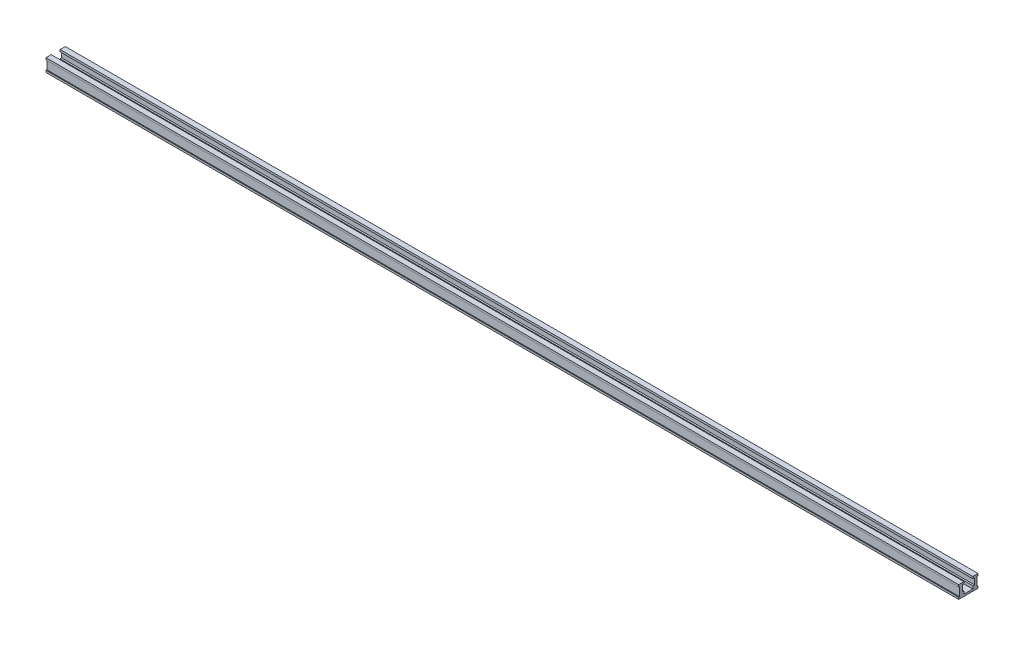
ISO-10303-21;
HEADER;
FILE_DESCRIPTION(('STEP AP214'),'2;1');
FILE_NAME('part.step','',(''),(''),'','','');
FILE_SCHEMA(('AUTOMOTIVE_DESIGN { 1 0 10303 214 1 1 1 1 }'));
ENDSEC;
DATA;
#1=APPLICATION_CONTEXT('core data for automotive mechanical design processes');
#2=APPLICATION_PROTOCOL_DEFINITION('international standard','automotive_design',2000,#1);
#3=PRODUCT_CONTEXT('',#1,'mechanical');
#4=PRODUCT('Part','Part','',(#3));
#5=PRODUCT_RELATED_PRODUCT_CATEGORY('part','',(#4));
#6=PRODUCT_DEFINITION_FORMATION('','',#4);
#7=PRODUCT_DEFINITION_CONTEXT('part definition',#1,'design');
#8=PRODUCT_DEFINITION('design','',#6,#7);
#9=PRODUCT_DEFINITION_SHAPE('','',#8);
#10=(LENGTH_UNIT() NAMED_UNIT(*) SI_UNIT(.MILLI.,.METRE.));
#11=(NAMED_UNIT(*) PLANE_ANGLE_UNIT() SI_UNIT($,.RADIAN.));
#12=(NAMED_UNIT(*) SI_UNIT($,.STERADIAN.) SOLID_ANGLE_UNIT());
#13=UNCERTAINTY_MEASURE_WITH_UNIT(LENGTH_MEASURE(1.E-05),#10,'distance_accuracy_value','');
#14=(GEOMETRIC_REPRESENTATION_CONTEXT(3) GLOBAL_UNCERTAINTY_ASSIGNED_CONTEXT((#13)) GLOBAL_UNIT_ASSIGNED_CONTEXT((#10,
#11,#12)) REPRESENTATION_CONTEXT('',''));
#15=CARTESIAN_POINT('',(0.,0.,0.));
#16=DIRECTION('',(0.,0.,1.));
#17=DIRECTION('',(1.,0.,0.));
#18=AXIS2_PLACEMENT_3D('',#15,#16,#17);
#19=CARTESIAN_POINT('',(900.,-9.45107636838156,-2.90949351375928));
#20=DIRECTION('',(0.,-1.,0.));
#21=DIRECTION('',(0.,0.,-1.));
#22=AXIS2_PLACEMENT_3D('',#19,#20,#21);
#23=PLANE('',#22);
#24=DIRECTION('',(0.,0.,1.));
#25=VECTOR('',#24,1.);
#26=CARTESIAN_POINT('',(0.,-9.45107636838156,-2.90949351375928));
#27=LINE('',#26,#25);
#28=CARTESIAN_POINT('',(0.,-9.45107636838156,-3.70324351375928));
#29=VERTEX_POINT('',#28);
#30=CARTESIAN_POINT('',(0.,-9.45107636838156,-2.90949351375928));
#31=VERTEX_POINT('',#30);
#32=EDGE_CURVE('E224',#29,#31,#27,.T.);
#33=ORIENTED_EDGE('',*,*,#32,.T.);
#34=DIRECTION('',(-1.,0.,0.));
#35=VECTOR('',#34,1.);
#36=CARTESIAN_POINT('',(900.,-9.45107636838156,-2.90949351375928));
#37=LINE('',#36,#35);
#38=CARTESIAN_POINT('',(900.,-9.45107636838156,-2.90949351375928));
#39=VERTEX_POINT('',#38);
#40=EDGE_CURVE('E11',#39,#31,#37,.T.);
#41=ORIENTED_EDGE('',*,*,#40,.F.);
#42=DIRECTION('',(0.,0.,1.));
#43=VECTOR('',#42,1.);
#44=CARTESIAN_POINT('',(900.,-9.45107636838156,-2.90949351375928));
#45=LINE('',#44,#43);
#46=CARTESIAN_POINT('',(900.,-9.45107636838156,-3.70324351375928));
#47=VERTEX_POINT('',#46);
#48=EDGE_CURVE('E270',#47,#39,#45,.T.);
#49=ORIENTED_EDGE('',*,*,#48,.F.);
#50=DIRECTION('',(-1.,0.,0.));
#51=VECTOR('',#50,1.);
#52=CARTESIAN_POINT('',(900.,-9.45107636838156,-3.70324351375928));
#53=LINE('',#52,#51);
#54=EDGE_CURVE('E220',#47,#29,#53,.T.);
#55=ORIENTED_EDGE('',*,*,#54,.T.);
#56=EDGE_LOOP('',(#33,#41,#49,#55));
#57=FACE_BOUND('',#56,.T.);
#58=ADVANCED_FACE('F32',(#57),#23,.F.);
#59=CARTESIAN_POINT('',(900.,-0.719826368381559,-2.90949351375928));
#60=DIRECTION('',(0.,0.,1.));
#61=DIRECTION('',(1.,0.,0.));
#62=AXIS2_PLACEMENT_3D('',#59,#60,#61);
#63=PLANE('',#62);
#64=DIRECTION('',(0.,1.,0.));
#65=VECTOR('',#64,1.);
#66=CARTESIAN_POINT('',(0.,-0.719826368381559,-2.90949351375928));
#67=LINE('',#66,#65);
#68=CARTESIAN_POINT('',(0.,-0.719826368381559,-2.90949351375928));
#69=VERTEX_POINT('',#68);
#70=EDGE_CURVE('E227',#31,#69,#67,.T.);
#71=ORIENTED_EDGE('',*,*,#70,.T.);
#72=DIRECTION('',(-1.,0.,0.));
#73=VECTOR('',#72,1.);
#74=CARTESIAN_POINT('',(900.,-0.719826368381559,-2.90949351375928));
#75=LINE('',#74,#73);
#76=CARTESIAN_POINT('',(900.,-0.719826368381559,-2.90949351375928));
#77=VERTEX_POINT('',#76);
#78=EDGE_CURVE('E40',#77,#69,#75,.T.);
#79=ORIENTED_EDGE('',*,*,#78,.F.);
#80=DIRECTION('',(0.,1.,0.));
#81=VECTOR('',#80,1.);
#82=CARTESIAN_POINT('',(900.,-0.719826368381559,-2.90949351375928));
#83=LINE('',#82,#81);
#84=EDGE_CURVE('E139',#39,#77,#83,.T.);
#85=ORIENTED_EDGE('',*,*,#84,.F.);
#86=ORIENTED_EDGE('',*,*,#40,.T.);
#87=EDGE_LOOP('',(#71,#79,#85,#86));
#88=FACE_BOUND('',#87,.T.);
#89=ADVANCED_FACE('F408',(#88),#63,.F.);
#90=CARTESIAN_POINT('',(900.,-0.719826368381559,-3.70324351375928));
#91=DIRECTION('',(0.,1.,0.));
#92=DIRECTION('',(0.,0.,1.));
#93=AXIS2_PLACEMENT_3D('',#90,#91,#92);
#94=PLANE('',#93);
#95=DIRECTION('',(0.,0.,-1.));
#96=VECTOR('',#95,1.);
#97=CARTESIAN_POINT('',(0.,-0.719826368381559,-3.70324351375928));
#98=LINE('',#97,#96);
#99=CARTESIAN_POINT('',(0.,-0.719826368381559,-3.70324351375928));
#100=VERTEX_POINT('',#99);
#101=EDGE_CURVE('E229',#69,#100,#98,.T.);
#102=ORIENTED_EDGE('',*,*,#101,.T.);
#103=DIRECTION('',(-1.,0.,0.));
#104=VECTOR('',#103,1.);
#105=CARTESIAN_POINT('',(900.,-0.719826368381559,-3.70324351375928));
#106=LINE('',#105,#104);
#107=CARTESIAN_POINT('',(900.,-0.719826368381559,-3.70324351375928));
#108=VERTEX_POINT('',#107);
#109=EDGE_CURVE('E325',#108,#100,#106,.T.);
#110=ORIENTED_EDGE('',*,*,#109,.F.);
#111=DIRECTION('',(0.,0.,-1.));
#112=VECTOR('',#111,1.);
#113=CARTESIAN_POINT('',(900.,-0.719826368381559,-3.70324351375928));
#114=LINE('',#113,#112);
#115=EDGE_CURVE('E333',#77,#108,#114,.T.);
#116=ORIENTED_EDGE('',*,*,#115,.F.);
#117=ORIENTED_EDGE('',*,*,#78,.T.);
#118=EDGE_LOOP('',(#102,#110,#116,#117));
#119=FACE_BOUND('',#118,.T.);
#120=ADVANCED_FACE('F331',(#119),#94,.F.);
#121=CARTESIAN_POINT('',(900.,1.26454863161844,-3.70324351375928));
#122=DIRECTION('',(0.,0.,1.));
#123=DIRECTION('',(1.,0.,0.));
#124=AXIS2_PLACEMENT_3D('',#121,#122,#123);
#125=PLANE('',#124);
#126=DIRECTION('',(0.,1.,0.));
#127=VECTOR('',#126,1.);
#128=CARTESIAN_POINT('',(0.,1.26454863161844,-3.70324351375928));
#129=LINE('',#128,#127);
#130=CARTESIAN_POINT('',(0.,1.26454863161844,-3.70324351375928));
#131=VERTEX_POINT('',#130);
#132=EDGE_CURVE('E231',#100,#131,#129,.T.);
#133=ORIENTED_EDGE('',*,*,#132,.T.);
#134=DIRECTION('',(-1.,0.,0.));
#135=VECTOR('',#134,1.);
#136=CARTESIAN_POINT('',(900.,1.26454863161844,-3.70324351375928));
#137=LINE('',#136,#135);
#138=CARTESIAN_POINT('',(900.,1.26454863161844,-3.70324351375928));
#139=VERTEX_POINT('',#138);
#140=EDGE_CURVE('E322',#139,#131,#137,.T.);
#141=ORIENTED_EDGE('',*,*,#140,.F.);
#142=DIRECTION('',(0.,1.,0.));
#143=VECTOR('',#142,1.);
#144=CARTESIAN_POINT('',(900.,1.26454863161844,-3.70324351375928));
#145=LINE('',#144,#143);
#146=EDGE_CURVE('E351',#108,#139,#145,.T.);
#147=ORIENTED_EDGE('',*,*,#146,.F.);
#148=ORIENTED_EDGE('',*,*,#109,.T.);
#149=EDGE_LOOP('',(#133,#141,#147,#148));
#150=FACE_BOUND('',#149,.T.);
#151=ADVANCED_FACE('F342',(#150),#125,.F.);
#152=CARTESIAN_POINT('',(900.,1.26454863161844,1.45613148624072));
#153=DIRECTION('',(0.,-1.,0.));
#154=DIRECTION('',(0.,0.,-1.));
#155=AXIS2_PLACEMENT_3D('',#152,#153,#154);
#156=PLANE('',#155);
#157=DIRECTION('',(0.,0.,1.));
#158=VECTOR('',#157,1.);
#159=CARTESIAN_POINT('',(0.,1.26454863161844,1.45613148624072));
#160=LINE('',#159,#158);
#161=CARTESIAN_POINT('',(0.,1.26454863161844,1.45613148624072));
#162=VERTEX_POINT('',#161);
#163=EDGE_CURVE('E233',#131,#162,#160,.T.);
#164=ORIENTED_EDGE('',*,*,#163,.T.);
#165=DIRECTION('',(-1.,0.,0.));
#166=VECTOR('',#165,1.);
#167=CARTESIAN_POINT('',(900.,1.26454863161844,1.45613148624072));
#168=LINE('',#167,#166);
#169=CARTESIAN_POINT('',(900.,1.26454863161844,1.45613148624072));
#170=VERTEX_POINT('',#169);
#171=EDGE_CURVE('E319',#170,#162,#168,.T.);
#172=ORIENTED_EDGE('',*,*,#171,.F.);
#173=DIRECTION('',(0.,0.,1.));
#174=VECTOR('',#173,1.);
#175=CARTESIAN_POINT('',(900.,1.26454863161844,1.45613148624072));
#176=LINE('',#175,#174);
#177=EDGE_CURVE('E348',#139,#170,#176,.T.);
#178=ORIENTED_EDGE('',*,*,#177,.F.);
#179=ORIENTED_EDGE('',*,*,#140,.T.);
#180=EDGE_LOOP('',(#164,#172,#178,#179));
#181=FACE_BOUND('',#180,.T.);
#182=ADVANCED_FACE('F346',(#181),#156,.F.);
#183=CARTESIAN_POINT('',(900.,-0.719826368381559,1.45613148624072));
#184=DIRECTION('',(0.,0.,-1.));
#185=DIRECTION('',(-1.,0.,0.));
#186=AXIS2_PLACEMENT_3D('',#183,#184,#185);
#187=PLANE('',#186);
#188=DIRECTION('',(0.,-1.,0.));
#189=VECTOR('',#188,1.);
#190=CARTESIAN_POINT('',(0.,-0.719826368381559,1.45613148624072));
#191=LINE('',#190,#189);
#192=CARTESIAN_POINT('',(0.,-0.719826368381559,1.45613148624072));
#193=VERTEX_POINT('',#192);
#194=EDGE_CURVE('E235',#162,#193,#191,.T.);
#195=ORIENTED_EDGE('',*,*,#194,.T.);
#196=DIRECTION('',(-1.,0.,0.));
#197=VECTOR('',#196,1.);
#198=CARTESIAN_POINT('',(900.,-0.719826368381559,1.45613148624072));
#199=LINE('',#198,#197);
#200=CARTESIAN_POINT('',(900.,-0.719826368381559,1.45613148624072));
#201=VERTEX_POINT('',#200);
#202=EDGE_CURVE('E316',#201,#193,#199,.T.);
#203=ORIENTED_EDGE('',*,*,#202,.F.);
#204=DIRECTION('',(0.,-1.,0.));
#205=VECTOR('',#204,1.);
#206=CARTESIAN_POINT('',(900.,-0.719826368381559,1.45613148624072));
#207=LINE('',#206,#205);
#208=EDGE_CURVE('E350',#170,#201,#207,.T.);
#209=ORIENTED_EDGE('',*,*,#208,.F.);
#210=ORIENTED_EDGE('',*,*,#171,.T.);
#211=EDGE_LOOP('',(#195,#203,#209,#210));
#212=FACE_BOUND('',#211,.T.);
#213=ADVANCED_FACE('F421',(#212),#187,.F.);
#214=CARTESIAN_POINT('',(900.,-0.719826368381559,-0.131368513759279));
#215=DIRECTION('',(0.,1.,0.));
#216=DIRECTION('',(0.,0.,1.));
#217=AXIS2_PLACEMENT_3D('',#214,#215,#216);
#218=PLANE('',#217);
#219=DIRECTION('',(0.,0.,-1.));
#220=VECTOR('',#219,1.);
#221=CARTESIAN_POINT('',(0.,-0.719826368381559,-0.131368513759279));
#222=LINE('',#221,#220);
#223=CARTESIAN_POINT('',(0.,-0.719826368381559,-0.131368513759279));
#224=VERTEX_POINT('',#223);
#225=EDGE_CURVE('E237',#193,#224,#222,.T.);
#226=ORIENTED_EDGE('',*,*,#225,.T.);
#227=DIRECTION('',(-1.,0.,0.));
#228=VECTOR('',#227,1.);
#229=CARTESIAN_POINT('',(900.,-0.719826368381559,-0.131368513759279));
#230=LINE('',#229,#228);
#231=CARTESIAN_POINT('',(900.,-0.719826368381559,-0.131368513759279));
#232=VERTEX_POINT('',#231);
#233=EDGE_CURVE('E313',#232,#224,#230,.T.);
#234=ORIENTED_EDGE('',*,*,#233,.F.);
#235=DIRECTION('',(0.,0.,-1.));
#236=VECTOR('',#235,1.);
#237=CARTESIAN_POINT('',(900.,-0.719826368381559,-0.131368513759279));
#238=LINE('',#237,#236);
#239=EDGE_CURVE('E353',#201,#232,#238,.T.);
#240=ORIENTED_EDGE('',*,*,#239,.F.);
#241=ORIENTED_EDGE('',*,*,#202,.T.);
#242=EDGE_LOOP('',(#226,#234,#240,#241));
#243=FACE_BOUND('',#242,.T.);
#244=ADVANCED_FACE('F424',(#243),#218,.F.);
#245=CARTESIAN_POINT('',(900.,-6.67295136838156,-0.131368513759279));
#246=DIRECTION('',(0.,0.,-1.));
#247=DIRECTION('',(-1.,0.,0.));
#248=AXIS2_PLACEMENT_3D('',#245,#246,#247);
#249=PLANE('',#248);
#250=DIRECTION('',(0.,-1.,0.));
#251=VECTOR('',#250,1.);
#252=CARTESIAN_POINT('',(0.,-6.67295136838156,-0.131368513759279));
#253=LINE('',#252,#251);
#254=CARTESIAN_POINT('',(0.,-6.67295136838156,-0.131368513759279));
#255=VERTEX_POINT('',#254);
#256=EDGE_CURVE('E239',#224,#255,#253,.T.);
#257=ORIENTED_EDGE('',*,*,#256,.T.);
#258=DIRECTION('',(-1.,0.,0.));
#259=VECTOR('',#258,1.);
#260=CARTESIAN_POINT('',(900.,-6.67295136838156,-0.131368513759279));
#261=LINE('',#260,#259);
#262=CARTESIAN_POINT('',(900.,-6.67295136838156,-0.131368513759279));
#263=VERTEX_POINT('',#262);
#264=EDGE_CURVE('E310',#263,#255,#261,.T.);
#265=ORIENTED_EDGE('',*,*,#264,.F.);
#266=DIRECTION('',(0.,-1.,0.));
#267=VECTOR('',#266,1.);
#268=CARTESIAN_POINT('',(900.,-6.67295136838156,-0.131368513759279));
#269=LINE('',#268,#267);
#270=EDGE_CURVE('E359',#232,#263,#269,.T.);
#271=ORIENTED_EDGE('',*,*,#270,.F.);
#272=ORIENTED_EDGE('',*,*,#233,.T.);
#273=EDGE_LOOP('',(#257,#265,#271,#272));
#274=FACE_BOUND('',#273,.T.);
#275=ADVANCED_FACE('F428',(#274),#249,.F.);
#276=CARTESIAN_POINT('',(900.,-6.67295136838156,1.45613148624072));
#277=DIRECTION('',(0.,-1.,0.));
#278=DIRECTION('',(0.,0.,-1.));
#279=AXIS2_PLACEMENT_3D('',#276,#277,#278);
#280=PLANE('',#279);
#281=DIRECTION('',(0.,0.,1.));
#282=VECTOR('',#281,1.);
#283=CARTESIAN_POINT('',(0.,-6.67295136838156,1.45613148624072));
#284=LINE('',#283,#282);
#285=CARTESIAN_POINT('',(0.,-6.67295136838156,1.45613148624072));
#286=VERTEX_POINT('',#285);
#287=EDGE_CURVE('E241',#255,#286,#284,.T.);
#288=ORIENTED_EDGE('',*,*,#287,.T.);
#289=DIRECTION('',(-1.,0.,0.));
#290=VECTOR('',#289,1.);
#291=CARTESIAN_POINT('',(900.,-6.67295136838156,1.45613148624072));
#292=LINE('',#291,#290);
#293=CARTESIAN_POINT('',(900.,-6.67295136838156,1.45613148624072));
#294=VERTEX_POINT('',#293);
#295=EDGE_CURVE('E307',#294,#286,#292,.T.);
#296=ORIENTED_EDGE('',*,*,#295,.F.);
#297=DIRECTION('',(0.,0.,1.));
#298=VECTOR('',#297,1.);
#299=CARTESIAN_POINT('',(900.,-6.67295136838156,1.45613148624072));
#300=LINE('',#299,#298);
#301=EDGE_CURVE('E361',#263,#294,#300,.T.);
#302=ORIENTED_EDGE('',*,*,#301,.F.);
#303=ORIENTED_EDGE('',*,*,#264,.T.);
#304=EDGE_LOOP('',(#288,#296,#302,#303));
#305=FACE_BOUND('',#304,.T.);
#306=ADVANCED_FACE('F432',(#305),#280,.F.);
#307=CARTESIAN_POINT('',(900.,-9.45107636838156,1.45613148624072));
#308=DIRECTION('',(0.,0.,-1.));
#309=DIRECTION('',(-1.,0.,0.));
#310=AXIS2_PLACEMENT_3D('',#307,#308,#309);
#311=PLANE('',#310);
#312=DIRECTION('',(0.,-1.,0.));
#313=VECTOR('',#312,1.);
#314=CARTESIAN_POINT('',(0.,-9.45107636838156,1.45613148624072));
#315=LINE('',#314,#313);
#316=CARTESIAN_POINT('',(0.,-9.45107636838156,1.45613148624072));
#317=VERTEX_POINT('',#316);
#318=EDGE_CURVE('E243',#286,#317,#315,.T.);
#319=ORIENTED_EDGE('',*,*,#318,.T.);
#320=DIRECTION('',(-1.,0.,0.));
#321=VECTOR('',#320,1.);
#322=CARTESIAN_POINT('',(900.,-9.45107636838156,1.45613148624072));
#323=LINE('',#322,#321);
#324=CARTESIAN_POINT('',(900.,-9.45107636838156,1.45613148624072));
#325=VERTEX_POINT('',#324);
#326=EDGE_CURVE('E304',#325,#317,#323,.T.);
#327=ORIENTED_EDGE('',*,*,#326,.F.);
#328=DIRECTION('',(0.,-1.,0.));
#329=VECTOR('',#328,1.);
#330=CARTESIAN_POINT('',(900.,-9.45107636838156,1.45613148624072));
#331=LINE('',#330,#329);
#332=EDGE_CURVE('E363',#294,#325,#331,.T.);
#333=ORIENTED_EDGE('',*,*,#332,.F.);
#334=ORIENTED_EDGE('',*,*,#295,.T.);
#335=EDGE_LOOP('',(#319,#327,#333,#334));
#336=FACE_BOUND('',#335,.T.);
#337=ADVANCED_FACE('F436',(#336),#311,.F.);
#338=CARTESIAN_POINT('',(900.,-9.45107636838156,1.45613148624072));
#339=DIRECTION('',(0.,-1.,0.));
#340=DIRECTION('',(0.,0.,-1.));
#341=AXIS2_PLACEMENT_3D('',#338,#339,#340);
#342=PLANE('',#341);
#343=DIRECTION('',(0.,0.,1.));
#344=VECTOR('',#343,1.);
#345=CARTESIAN_POINT('',(0.,-9.45107636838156,1.45613148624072));
#346=LINE('',#345,#344);
#347=CARTESIAN_POINT('',(0.,-9.45107636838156,10.1873814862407));
#348=VERTEX_POINT('',#347);
#349=EDGE_CURVE('E245',#317,#348,#346,.T.);
#350=ORIENTED_EDGE('',*,*,#349,.T.);
#351=DIRECTION('',(-1.,0.,0.));
#352=VECTOR('',#351,1.);
#353=CARTESIAN_POINT('',(900.,-9.45107636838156,10.1873814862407));
#354=LINE('',#353,#352);
#355=CARTESIAN_POINT('',(900.,-9.45107636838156,10.1873814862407));
#356=VERTEX_POINT('',#355);
#357=EDGE_CURVE('E301',#356,#348,#354,.T.);
#358=ORIENTED_EDGE('',*,*,#357,.F.);
#359=DIRECTION('',(0.,0.,1.));
#360=VECTOR('',#359,1.);
#361=CARTESIAN_POINT('',(900.,-9.45107636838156,1.45613148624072));
#362=LINE('',#361,#360);
#363=EDGE_CURVE('E365',#325,#356,#362,.T.);
#364=ORIENTED_EDGE('',*,*,#363,.F.);
#365=ORIENTED_EDGE('',*,*,#326,.T.);
#366=EDGE_LOOP('',(#350,#358,#364,#365));
#367=FACE_BOUND('',#366,.T.);
#368=ADVANCED_FACE('F440',(#367),#342,.F.);
#369=CARTESIAN_POINT('',(900.,-6.67295136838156,10.1873814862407));
#370=DIRECTION('',(0.,0.,1.));
#371=DIRECTION('',(1.,0.,0.));
#372=AXIS2_PLACEMENT_3D('',#369,#370,#371);
#373=PLANE('',#372);
#374=DIRECTION('',(0.,1.,0.));
#375=VECTOR('',#374,1.);
#376=CARTESIAN_POINT('',(0.,-6.67295136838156,10.1873814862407));
#377=LINE('',#376,#375);
#378=CARTESIAN_POINT('',(0.,-6.67295136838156,10.1873814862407));
#379=VERTEX_POINT('',#378);
#380=EDGE_CURVE('E247',#348,#379,#377,.T.);
#381=ORIENTED_EDGE('',*,*,#380,.T.);
#382=DIRECTION('',(-1.,0.,0.));
#383=VECTOR('',#382,1.);
#384=CARTESIAN_POINT('',(900.,-6.67295136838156,10.1873814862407));
#385=LINE('',#384,#383);
#386=CARTESIAN_POINT('',(900.,-6.67295136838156,10.1873814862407));
#387=VERTEX_POINT('',#386);
#388=EDGE_CURVE('E298',#387,#379,#385,.T.);
#389=ORIENTED_EDGE('',*,*,#388,.F.);
#390=DIRECTION('',(0.,1.,0.));
#391=VECTOR('',#390,1.);
#392=CARTESIAN_POINT('',(900.,-6.67295136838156,10.1873814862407));
#393=LINE('',#392,#391);
#394=EDGE_CURVE('E367',#356,#387,#393,.T.);
#395=ORIENTED_EDGE('',*,*,#394,.F.);
#396=ORIENTED_EDGE('',*,*,#357,.T.);
#397=EDGE_LOOP('',(#381,#389,#395,#396));
#398=FACE_BOUND('',#397,.T.);
#399=ADVANCED_FACE('F444',(#398),#373,.F.);
#400=CARTESIAN_POINT('',(900.,-6.67295136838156,11.7748814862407));
#401=DIRECTION('',(0.,-1.,0.));
#402=DIRECTION('',(0.,0.,-1.));
#403=AXIS2_PLACEMENT_3D('',#400,#401,#402);
#404=PLANE('',#403);
#405=DIRECTION('',(0.,0.,1.));
#406=VECTOR('',#405,1.);
#407=CARTESIAN_POINT('',(0.,-6.67295136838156,11.7748814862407));
#408=LINE('',#407,#406);
#409=CARTESIAN_POINT('',(0.,-6.67295136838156,11.7748814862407));
#410=VERTEX_POINT('',#409);
#411=EDGE_CURVE('E249',#379,#410,#408,.T.);
#412=ORIENTED_EDGE('',*,*,#411,.T.);
#413=DIRECTION('',(-1.,0.,0.));
#414=VECTOR('',#413,1.);
#415=CARTESIAN_POINT('',(900.,-6.67295136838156,11.7748814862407));
#416=LINE('',#415,#414);
#417=CARTESIAN_POINT('',(900.,-6.67295136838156,11.7748814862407));
#418=VERTEX_POINT('',#417);
#419=EDGE_CURVE('E295',#418,#410,#416,.T.);
#420=ORIENTED_EDGE('',*,*,#419,.F.);
#421=DIRECTION('',(0.,0.,1.));
#422=VECTOR('',#421,1.);
#423=CARTESIAN_POINT('',(900.,-6.67295136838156,11.7748814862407));
#424=LINE('',#423,#422);
#425=EDGE_CURVE('E369',#387,#418,#424,.T.);
#426=ORIENTED_EDGE('',*,*,#425,.F.);
#427=ORIENTED_EDGE('',*,*,#388,.T.);
#428=EDGE_LOOP('',(#412,#420,#426,#427));
#429=FACE_BOUND('',#428,.T.);
#430=ADVANCED_FACE('F448',(#429),#404,.F.);
#431=CARTESIAN_POINT('',(900.,-0.719826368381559,11.7748814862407));
#432=DIRECTION('',(0.,0.,1.));
#433=DIRECTION('',(1.,0.,0.));
#434=AXIS2_PLACEMENT_3D('',#431,#432,#433);
#435=PLANE('',#434);
#436=DIRECTION('',(0.,1.,0.));
#437=VECTOR('',#436,1.);
#438=CARTESIAN_POINT('',(0.,-0.719826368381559,11.7748814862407));
#439=LINE('',#438,#437);
#440=CARTESIAN_POINT('',(0.,-0.719826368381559,11.7748814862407));
#441=VERTEX_POINT('',#440);
#442=EDGE_CURVE('E251',#410,#441,#439,.T.);
#443=ORIENTED_EDGE('',*,*,#442,.T.);
#444=DIRECTION('',(-1.,0.,0.));
#445=VECTOR('',#444,1.);
#446=CARTESIAN_POINT('',(900.,-0.719826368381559,11.7748814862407));
#447=LINE('',#446,#445);
#448=CARTESIAN_POINT('',(900.,-0.719826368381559,11.7748814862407));
#449=VERTEX_POINT('',#448);
#450=EDGE_CURVE('E292',#449,#441,#447,.T.);
#451=ORIENTED_EDGE('',*,*,#450,.F.);
#452=DIRECTION('',(0.,1.,0.));
#453=VECTOR('',#452,1.);
#454=CARTESIAN_POINT('',(900.,-0.719826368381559,11.7748814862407));
#455=LINE('',#454,#453);
#456=EDGE_CURVE('E371',#418,#449,#455,.T.);
#457=ORIENTED_EDGE('',*,*,#456,.F.);
#458=ORIENTED_EDGE('',*,*,#419,.T.);
#459=EDGE_LOOP('',(#443,#451,#457,#458));
#460=FACE_BOUND('',#459,.T.);
#461=ADVANCED_FACE('F452',(#460),#435,.F.);
#462=CARTESIAN_POINT('',(900.,-0.719826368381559,10.1873814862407));
#463=DIRECTION('',(0.,1.,0.));
#464=DIRECTION('',(0.,0.,1.));
#465=AXIS2_PLACEMENT_3D('',#462,#463,#464);
#466=PLANE('',#465);
#467=DIRECTION('',(0.,0.,-1.));
#468=VECTOR('',#467,1.);
#469=CARTESIAN_POINT('',(0.,-0.719826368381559,10.1873814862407));
#470=LINE('',#469,#468);
#471=CARTESIAN_POINT('',(0.,-0.719826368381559,10.1873814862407));
#472=VERTEX_POINT('',#471);
#473=EDGE_CURVE('E253',#441,#472,#470,.T.);
#474=ORIENTED_EDGE('',*,*,#473,.T.);
#475=DIRECTION('',(-1.,0.,0.));
#476=VECTOR('',#475,1.);
#477=CARTESIAN_POINT('',(900.,-0.719826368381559,10.1873814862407));
#478=LINE('',#477,#476);
#479=CARTESIAN_POINT('',(900.,-0.719826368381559,10.1873814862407));
#480=VERTEX_POINT('',#479);
#481=EDGE_CURVE('E289',#480,#472,#478,.T.);
#482=ORIENTED_EDGE('',*,*,#481,.F.);
#483=DIRECTION('',(0.,0.,-1.));
#484=VECTOR('',#483,1.);
#485=CARTESIAN_POINT('',(900.,-0.719826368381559,10.1873814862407));
#486=LINE('',#485,#484);
#487=EDGE_CURVE('E373',#449,#480,#486,.T.);
#488=ORIENTED_EDGE('',*,*,#487,.F.);
#489=ORIENTED_EDGE('',*,*,#450,.T.);
#490=EDGE_LOOP('',(#474,#482,#488,#489));
#491=FACE_BOUND('',#490,.T.);
#492=ADVANCED_FACE('F456',(#491),#466,.F.);
#493=CARTESIAN_POINT('',(900.,1.26454863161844,10.1873814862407));
#494=DIRECTION('',(0.,0.,1.));
#495=DIRECTION('',(1.,0.,0.));
#496=AXIS2_PLACEMENT_3D('',#493,#494,#495);
#497=PLANE('',#496);
#498=DIRECTION('',(0.,1.,0.));
#499=VECTOR('',#498,1.);
#500=CARTESIAN_POINT('',(0.,1.26454863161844,10.1873814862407));
#501=LINE('',#500,#499);
#502=CARTESIAN_POINT('',(0.,1.26454863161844,10.1873814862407));
#503=VERTEX_POINT('',#502);
#504=EDGE_CURVE('E255',#472,#503,#501,.T.);
#505=ORIENTED_EDGE('',*,*,#504,.T.);
#506=DIRECTION('',(-1.,0.,0.));
#507=VECTOR('',#506,1.);
#508=CARTESIAN_POINT('',(900.,1.26454863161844,10.1873814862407));
#509=LINE('',#508,#507);
#510=CARTESIAN_POINT('',(900.,1.26454863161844,10.1873814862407));
#511=VERTEX_POINT('',#510);
#512=EDGE_CURVE('E286',#511,#503,#509,.T.);
#513=ORIENTED_EDGE('',*,*,#512,.F.);
#514=DIRECTION('',(0.,1.,0.));
#515=VECTOR('',#514,1.);
#516=CARTESIAN_POINT('',(900.,1.26454863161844,10.1873814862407));
#517=LINE('',#516,#515);
#518=EDGE_CURVE('E375',#480,#511,#517,.T.);
#519=ORIENTED_EDGE('',*,*,#518,.F.);
#520=ORIENTED_EDGE('',*,*,#481,.T.);
#521=EDGE_LOOP('',(#505,#513,#519,#520));
#522=FACE_BOUND('',#521,.T.);
#523=ADVANCED_FACE('F460',(#522),#497,.F.);
#524=CARTESIAN_POINT('',(900.,1.26454863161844,15.3467564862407));
#525=DIRECTION('',(0.,-1.,0.));
#526=DIRECTION('',(0.,0.,-1.));
#527=AXIS2_PLACEMENT_3D('',#524,#525,#526);
#528=PLANE('',#527);
#529=DIRECTION('',(0.,0.,1.));
#530=VECTOR('',#529,1.);
#531=CARTESIAN_POINT('',(0.,1.26454863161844,15.3467564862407));
#532=LINE('',#531,#530);
#533=CARTESIAN_POINT('',(0.,1.26454863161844,15.3467564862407));
#534=VERTEX_POINT('',#533);
#535=EDGE_CURVE('E257',#503,#534,#532,.T.);
#536=ORIENTED_EDGE('',*,*,#535,.T.);
#537=DIRECTION('',(-1.,0.,0.));
#538=VECTOR('',#537,1.);
#539=CARTESIAN_POINT('',(900.,1.26454863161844,15.3467564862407));
#540=LINE('',#539,#538);
#541=CARTESIAN_POINT('',(900.,1.26454863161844,15.3467564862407));
#542=VERTEX_POINT('',#541);
#543=EDGE_CURVE('E283',#542,#534,#540,.T.);
#544=ORIENTED_EDGE('',*,*,#543,.F.);
#545=DIRECTION('',(0.,0.,1.));
#546=VECTOR('',#545,1.);
#547=CARTESIAN_POINT('',(900.,1.26454863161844,15.3467564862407));
#548=LINE('',#547,#546);
#549=EDGE_CURVE('E377',#511,#542,#548,.T.);
#550=ORIENTED_EDGE('',*,*,#549,.F.);
#551=ORIENTED_EDGE('',*,*,#512,.T.);
#552=EDGE_LOOP('',(#536,#544,#550,#551));
#553=FACE_BOUND('',#552,.T.);
#554=ADVANCED_FACE('F464',(#553),#528,.F.);
#555=CARTESIAN_POINT('',(900.,-0.719826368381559,15.3467564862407));
#556=DIRECTION('',(0.,0.,-1.));
#557=DIRECTION('',(-1.,0.,0.));
#558=AXIS2_PLACEMENT_3D('',#555,#556,#557);
#559=PLANE('',#558);
#560=DIRECTION('',(0.,-1.,0.));
#561=VECTOR('',#560,1.);
#562=CARTESIAN_POINT('',(0.,-0.719826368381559,15.3467564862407));
#563=LINE('',#562,#561);
#564=CARTESIAN_POINT('',(0.,-0.719826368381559,15.3467564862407));
#565=VERTEX_POINT('',#564);
#566=EDGE_CURVE('E259',#534,#565,#563,.T.);
#567=ORIENTED_EDGE('',*,*,#566,.T.);
#568=DIRECTION('',(-1.,0.,0.));
#569=VECTOR('',#568,1.);
#570=CARTESIAN_POINT('',(900.,-0.719826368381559,15.3467564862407));
#571=LINE('',#570,#569);
#572=CARTESIAN_POINT('',(900.,-0.719826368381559,15.3467564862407));
#573=VERTEX_POINT('',#572);
#574=EDGE_CURVE('E280',#573,#565,#571,.T.);
#575=ORIENTED_EDGE('',*,*,#574,.F.);
#576=DIRECTION('',(0.,-1.,0.));
#577=VECTOR('',#576,1.);
#578=CARTESIAN_POINT('',(900.,-0.719826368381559,15.3467564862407));
#579=LINE('',#578,#577);
#580=EDGE_CURVE('E379',#542,#573,#579,.T.);
#581=ORIENTED_EDGE('',*,*,#580,.F.);
#582=ORIENTED_EDGE('',*,*,#543,.T.);
#583=EDGE_LOOP('',(#567,#575,#581,#582));
#584=FACE_BOUND('',#583,.T.);
#585=ADVANCED_FACE('F468',(#584),#559,.F.);
#586=CARTESIAN_POINT('',(900.,-0.719826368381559,14.5530064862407));
#587=DIRECTION('',(0.,1.,0.));
#588=DIRECTION('',(0.,0.,1.));
#589=AXIS2_PLACEMENT_3D('',#586,#587,#588);
#590=PLANE('',#589);
#591=DIRECTION('',(0.,0.,-1.));
#592=VECTOR('',#591,1.);
#593=CARTESIAN_POINT('',(0.,-0.719826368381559,14.5530064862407));
#594=LINE('',#593,#592);
#595=CARTESIAN_POINT('',(0.,-0.719826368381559,14.5530064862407));
#596=VERTEX_POINT('',#595);
#597=EDGE_CURVE('E261',#565,#596,#594,.T.);
#598=ORIENTED_EDGE('',*,*,#597,.T.);
#599=DIRECTION('',(-1.,0.,0.));
#600=VECTOR('',#599,1.);
#601=CARTESIAN_POINT('',(900.,-0.719826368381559,14.5530064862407));
#602=LINE('',#601,#600);
#603=CARTESIAN_POINT('',(900.,-0.719826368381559,14.5530064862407));
#604=VERTEX_POINT('',#603);
#605=EDGE_CURVE('E277',#604,#596,#602,.T.);
#606=ORIENTED_EDGE('',*,*,#605,.F.);
#607=DIRECTION('',(0.,0.,-1.));
#608=VECTOR('',#607,1.);
#609=CARTESIAN_POINT('',(900.,-0.719826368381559,14.5530064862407));
#610=LINE('',#609,#608);
#611=EDGE_CURVE('E381',#573,#604,#610,.T.);
#612=ORIENTED_EDGE('',*,*,#611,.F.);
#613=ORIENTED_EDGE('',*,*,#574,.T.);
#614=EDGE_LOOP('',(#598,#606,#612,#613));
#615=FACE_BOUND('',#614,.T.);
#616=ADVANCED_FACE('F472',(#615),#590,.F.);
#617=CARTESIAN_POINT('',(900.,-9.45107636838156,14.5530064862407));
#618=DIRECTION('',(0.,0.,-1.));
#619=DIRECTION('',(-1.,0.,0.));
#620=AXIS2_PLACEMENT_3D('',#617,#618,#619);
#621=PLANE('',#620);
#622=DIRECTION('',(0.,-1.,0.));
#623=VECTOR('',#622,1.);
#624=CARTESIAN_POINT('',(0.,-9.45107636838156,14.5530064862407));
#625=LINE('',#624,#623);
#626=CARTESIAN_POINT('',(0.,-9.45107636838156,14.5530064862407));
#627=VERTEX_POINT('',#626);
#628=EDGE_CURVE('E263',#596,#627,#625,.T.);
#629=ORIENTED_EDGE('',*,*,#628,.T.);
#630=DIRECTION('',(-1.,0.,0.));
#631=VECTOR('',#630,1.);
#632=CARTESIAN_POINT('',(900.,-9.45107636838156,14.5530064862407));
#633=LINE('',#632,#631);
#634=CARTESIAN_POINT('',(900.,-9.45107636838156,14.5530064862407));
#635=VERTEX_POINT('',#634);
#636=EDGE_CURVE('E274',#635,#627,#633,.T.);
#637=ORIENTED_EDGE('',*,*,#636,.F.);
#638=DIRECTION('',(0.,-1.,0.));
#639=VECTOR('',#638,1.);
#640=CARTESIAN_POINT('',(900.,-9.45107636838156,14.5530064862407));
#641=LINE('',#640,#639);
#642=EDGE_CURVE('E383',#604,#635,#641,.T.);
#643=ORIENTED_EDGE('',*,*,#642,.F.);
#644=ORIENTED_EDGE('',*,*,#605,.T.);
#645=EDGE_LOOP('',(#629,#637,#643,#644));
#646=FACE_BOUND('',#645,.T.);
#647=ADVANCED_FACE('F389',(#646),#621,.F.);
#648=CARTESIAN_POINT('',(900.,-9.45107636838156,15.3467564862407));
#649=DIRECTION('',(0.,-1.,0.));
#650=DIRECTION('',(0.,0.,-1.));
#651=AXIS2_PLACEMENT_3D('',#648,#649,#650);
#652=PLANE('',#651);
#653=DIRECTION('',(0.,0.,1.));
#654=VECTOR('',#653,1.);
#655=CARTESIAN_POINT('',(0.,-9.45107636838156,15.3467564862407));
#656=LINE('',#655,#654);
#657=CARTESIAN_POINT('',(0.,-9.45107636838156,15.3467564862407));
#658=VERTEX_POINT('',#657);
#659=EDGE_CURVE('E265',#627,#658,#656,.T.);
#660=ORIENTED_EDGE('',*,*,#659,.T.);
#661=DIRECTION('',(-1.,0.,0.));
#662=VECTOR('',#661,1.);
#663=CARTESIAN_POINT('',(900.,-9.45107636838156,15.3467564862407));
#664=LINE('',#663,#662);
#665=CARTESIAN_POINT('',(900.,-9.45107636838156,15.3467564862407));
#666=VERTEX_POINT('',#665);
#667=EDGE_CURVE('E215',#666,#658,#664,.T.);
#668=ORIENTED_EDGE('',*,*,#667,.F.);
#669=DIRECTION('',(0.,0.,1.));
#670=VECTOR('',#669,1.);
#671=CARTESIAN_POINT('',(900.,-9.45107636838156,15.3467564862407));
#672=LINE('',#671,#670);
#673=EDGE_CURVE('E206',#635,#666,#672,.T.);
#674=ORIENTED_EDGE('',*,*,#673,.F.);
#675=ORIENTED_EDGE('',*,*,#636,.T.);
#676=EDGE_LOOP('',(#660,#668,#674,#675));
#677=FACE_BOUND('',#676,.T.);
#678=ADVANCED_FACE('F393',(#677),#652,.F.);
#679=CARTESIAN_POINT('',(900.,-11.4354513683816,15.3467564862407));
#680=DIRECTION('',(0.,0.,-1.));
#681=DIRECTION('',(-1.,0.,0.));
#682=AXIS2_PLACEMENT_3D('',#679,#680,#681);
#683=PLANE('',#682);
#684=DIRECTION('',(0.,-1.,0.));
#685=VECTOR('',#684,1.);
#686=CARTESIAN_POINT('',(0.,-11.4354513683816,15.3467564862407));
#687=LINE('',#686,#685);
#688=CARTESIAN_POINT('',(0.,-11.4354513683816,15.3467564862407));
#689=VERTEX_POINT('',#688);
#690=EDGE_CURVE('E214',#658,#689,#687,.T.);
#691=ORIENTED_EDGE('',*,*,#690,.T.);
#692=DIRECTION('',(-1.,0.,0.));
#693=VECTOR('',#692,1.);
#694=CARTESIAN_POINT('',(900.,-11.4354513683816,15.3467564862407));
#695=LINE('',#694,#693);
#696=CARTESIAN_POINT('',(900.,-11.4354513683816,15.3467564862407));
#697=VERTEX_POINT('',#696);
#698=EDGE_CURVE('E211',#697,#689,#695,.T.);
#699=ORIENTED_EDGE('',*,*,#698,.F.);
#700=DIRECTION('',(0.,-1.,0.));
#701=VECTOR('',#700,1.);
#702=CARTESIAN_POINT('',(900.,-11.4354513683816,15.3467564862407));
#703=LINE('',#702,#701);
#704=EDGE_CURVE('E200',#666,#697,#703,.T.);
#705=ORIENTED_EDGE('',*,*,#704,.F.);
#706=ORIENTED_EDGE('',*,*,#667,.T.);
#707=EDGE_LOOP('',(#691,#699,#705,#706));
#708=FACE_BOUND('',#707,.T.);
#709=ADVANCED_FACE('F212',(#708),#683,.F.);
#710=CARTESIAN_POINT('',(900.,-11.4354513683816,-3.70324351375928));
#711=DIRECTION('',(0.,1.,0.));
#712=DIRECTION('',(0.,0.,1.));
#713=AXIS2_PLACEMENT_3D('',#710,#711,#712);
#714=PLANE('',#713);
#715=DIRECTION('',(0.,0.,-1.));
#716=VECTOR('',#715,1.);
#717=CARTESIAN_POINT('',(0.,-11.4354513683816,-3.70324351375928));
#718=LINE('',#717,#716);
#719=CARTESIAN_POINT('',(0.,-11.4354513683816,-3.70324351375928));
#720=VERTEX_POINT('',#719);
#721=EDGE_CURVE('E125',#689,#720,#718,.T.);
#722=ORIENTED_EDGE('',*,*,#721,.T.);
#723=DIRECTION('',(-1.,0.,0.));
#724=VECTOR('',#723,1.);
#725=CARTESIAN_POINT('',(900.,-11.4354513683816,-3.70324351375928));
#726=LINE('',#725,#724);
#727=CARTESIAN_POINT('',(900.,-11.4354513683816,-3.70324351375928));
#728=VERTEX_POINT('',#727);
#729=EDGE_CURVE('E216',#728,#720,#726,.T.);
#730=ORIENTED_EDGE('',*,*,#729,.F.);
#731=DIRECTION('',(0.,0.,-1.));
#732=VECTOR('',#731,1.);
#733=CARTESIAN_POINT('',(900.,-11.4354513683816,-3.70324351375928));
#734=LINE('',#733,#732);
#735=EDGE_CURVE('E204',#697,#728,#734,.T.);
#736=ORIENTED_EDGE('',*,*,#735,.F.);
#737=ORIENTED_EDGE('',*,*,#698,.T.);
#738=EDGE_LOOP('',(#722,#730,#736,#737));
#739=FACE_BOUND('',#738,.T.);
#740=ADVANCED_FACE('F218',(#739),#714,.F.);
#741=CARTESIAN_POINT('',(900.,-9.45107636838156,-3.70324351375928));
#742=DIRECTION('',(0.,0.,1.));
#743=DIRECTION('',(1.,0.,0.));
#744=AXIS2_PLACEMENT_3D('',#741,#742,#743);
#745=PLANE('',#744);
#746=DIRECTION('',(0.,1.,0.));
#747=VECTOR('',#746,1.);
#748=CARTESIAN_POINT('',(0.,-9.45107636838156,-3.70324351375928));
#749=LINE('',#748,#747);
#750=EDGE_CURVE('E131',#720,#29,#749,.T.);
#751=ORIENTED_EDGE('',*,*,#750,.T.);
#752=ORIENTED_EDGE('',*,*,#54,.F.);
#753=DIRECTION('',(0.,1.,0.));
#754=VECTOR('',#753,1.);
#755=CARTESIAN_POINT('',(900.,-9.45107636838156,-3.70324351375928));
#756=LINE('',#755,#754);
#757=EDGE_CURVE('E48',#728,#47,#756,.T.);
#758=ORIENTED_EDGE('',*,*,#757,.F.);
#759=ORIENTED_EDGE('',*,*,#729,.T.);
#760=EDGE_LOOP('',(#751,#752,#758,#759));
#761=FACE_BOUND('',#760,.T.);
#762=ADVANCED_FACE('F397',(#761),#745,.F.);
#763=CARTESIAN_POINT('',(900.,0.,0.));
#764=DIRECTION('',(-1.,0.,0.));
#765=DIRECTION('',(0.,0.,1.));
#766=AXIS2_PLACEMENT_3D('',#763,#764,#765);
#767=PLANE('',#766);
#768=ORIENTED_EDGE('',*,*,#48,.T.);
#769=ORIENTED_EDGE('',*,*,#84,.T.);
#770=ORIENTED_EDGE('',*,*,#115,.T.);
#771=ORIENTED_EDGE('',*,*,#146,.T.);
#772=ORIENTED_EDGE('',*,*,#177,.T.);
#773=ORIENTED_EDGE('',*,*,#208,.T.);
#774=ORIENTED_EDGE('',*,*,#239,.T.);
#775=ORIENTED_EDGE('',*,*,#270,.T.);
#776=ORIENTED_EDGE('',*,*,#301,.T.);
#777=ORIENTED_EDGE('',*,*,#332,.T.);
#778=ORIENTED_EDGE('',*,*,#363,.T.);
#779=ORIENTED_EDGE('',*,*,#394,.T.);
#780=ORIENTED_EDGE('',*,*,#425,.T.);
#781=ORIENTED_EDGE('',*,*,#456,.T.);
#782=ORIENTED_EDGE('',*,*,#487,.T.);
#783=ORIENTED_EDGE('',*,*,#518,.T.);
#784=ORIENTED_EDGE('',*,*,#549,.T.);
#785=ORIENTED_EDGE('',*,*,#580,.T.);
#786=ORIENTED_EDGE('',*,*,#611,.T.);
#787=ORIENTED_EDGE('',*,*,#642,.T.);
#788=ORIENTED_EDGE('',*,*,#673,.T.);
#789=ORIENTED_EDGE('',*,*,#704,.T.);
#790=ORIENTED_EDGE('',*,*,#735,.T.);
#791=ORIENTED_EDGE('',*,*,#757,.T.);
#792=EDGE_LOOP('',(#768,#769,#770,#771,#772,#773,#774,#775,#776,#777,#778,#779,#780,#781,#782,
#783,#784,#785,#786,#787,#788,#789,#790,#791));
#793=FACE_BOUND('',#792,.T.);
#794=ADVANCED_FACE('F202',(#793),#767,.F.);
#795=CARTESIAN_POINT('',(0.,0.,0.));
#796=DIRECTION('',(-1.,0.,0.));
#797=DIRECTION('',(0.,0.,1.));
#798=AXIS2_PLACEMENT_3D('',#795,#796,#797);
#799=PLANE('',#798);
#800=ORIENTED_EDGE('',*,*,#32,.F.);
#801=ORIENTED_EDGE('',*,*,#750,.F.);
#802=ORIENTED_EDGE('',*,*,#721,.F.);
#803=ORIENTED_EDGE('',*,*,#690,.F.);
#804=ORIENTED_EDGE('',*,*,#659,.F.);
#805=ORIENTED_EDGE('',*,*,#628,.F.);
#806=ORIENTED_EDGE('',*,*,#597,.F.);
#807=ORIENTED_EDGE('',*,*,#566,.F.);
#808=ORIENTED_EDGE('',*,*,#535,.F.);
#809=ORIENTED_EDGE('',*,*,#504,.F.);
#810=ORIENTED_EDGE('',*,*,#473,.F.);
#811=ORIENTED_EDGE('',*,*,#442,.F.);
#812=ORIENTED_EDGE('',*,*,#411,.F.);
#813=ORIENTED_EDGE('',*,*,#380,.F.);
#814=ORIENTED_EDGE('',*,*,#349,.F.);
#815=ORIENTED_EDGE('',*,*,#318,.F.);
#816=ORIENTED_EDGE('',*,*,#287,.F.);
#817=ORIENTED_EDGE('',*,*,#256,.F.);
#818=ORIENTED_EDGE('',*,*,#225,.F.);
#819=ORIENTED_EDGE('',*,*,#194,.F.);
#820=ORIENTED_EDGE('',*,*,#163,.F.);
#821=ORIENTED_EDGE('',*,*,#132,.F.);
#822=ORIENTED_EDGE('',*,*,#101,.F.);
#823=ORIENTED_EDGE('',*,*,#70,.F.);
#824=EDGE_LOOP('',(#800,#801,#802,#803,#804,#805,#806,#807,#808,#809,#810,#811,#812,#813,#814,
#815,#816,#817,#818,#819,#820,#821,#822,#823));
#825=FACE_BOUND('',#824,.T.);
#826=ADVANCED_FACE('F337',(#825),#799,.T.);
#827=CLOSED_SHELL('',(#58,#89,#120,#151,#182,#213,#244,#275,#306,#337,#368,#399,#430,#461,#492,
#523,#554,#585,#616,#647,#678,#709,#740,#762,#794,#826));
#828=MANIFOLD_SOLID_BREP('B2',#827);
#829=ADVANCED_BREP_SHAPE_REPRESENTATION('',(#18,#828),#14);
#830=SHAPE_DEFINITION_REPRESENTATION(#9,#829);
ENDSEC;
END-ISO-10303-21;
